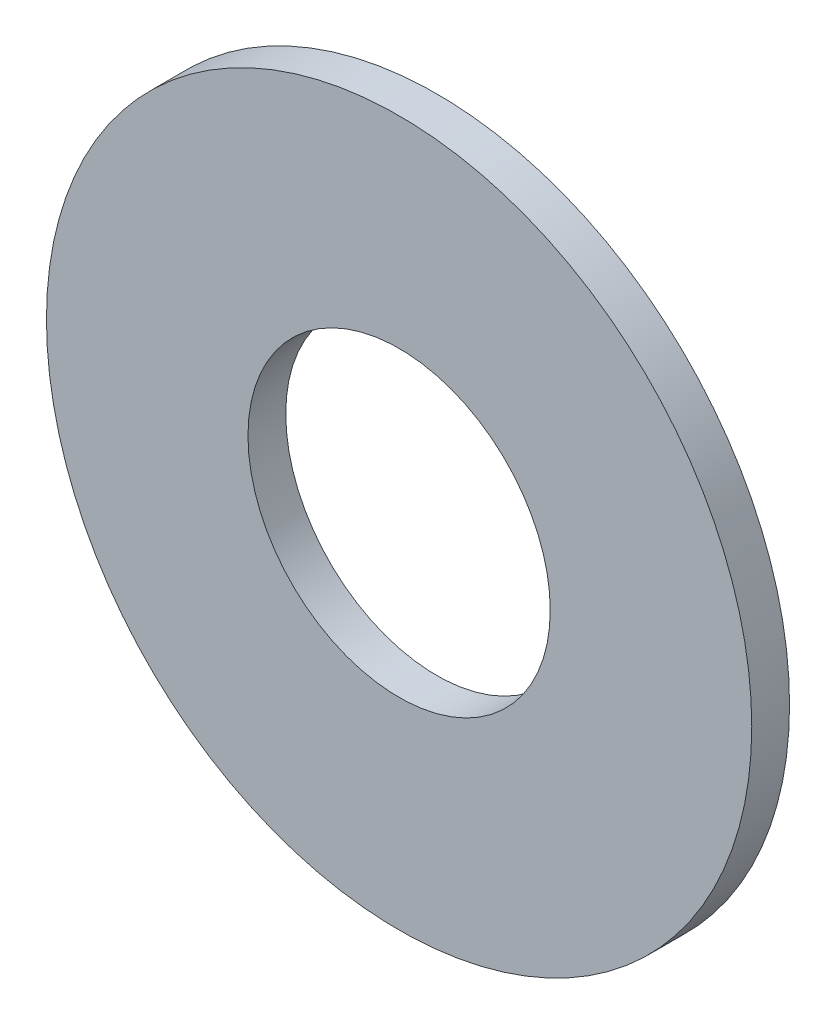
from build123d import *

# Parameters (mm, degrees)
ESQUISSE1_R      = 28
ESQUISSE1_R_2    = 12
EXTRUSION1_DEPTH = 3


with BuildPart() as part:
    # Esquisse1 → Extrusion1 (new body)
    with BuildSketch(Plane.XY):
        Circle(ESQUISSE1_R)
        Circle(ESQUISSE1_R_2, mode=Mode.SUBTRACT)
    extrude(amount=EXTRUSION1_DEPTH)


solid = part.part
